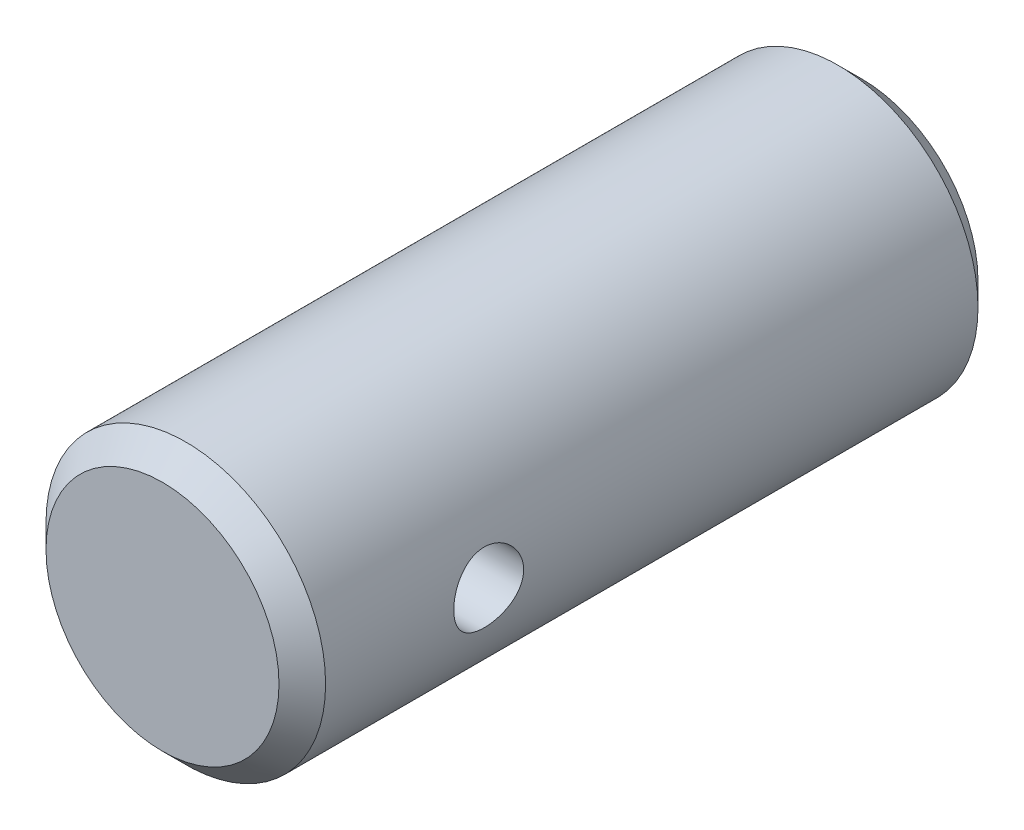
ISO-10303-21;
HEADER;
FILE_DESCRIPTION(('STEP AP214'),'2;1');
FILE_NAME('part.step','',(''),(''),'','','');
FILE_SCHEMA(('AUTOMOTIVE_DESIGN { 1 0 10303 214 1 1 1 1 }'));
ENDSEC;
DATA;
#1=APPLICATION_CONTEXT('core data for automotive mechanical design processes');
#2=APPLICATION_PROTOCOL_DEFINITION('international standard','automotive_design',2000,#1);
#3=PRODUCT_CONTEXT('',#1,'mechanical');
#4=PRODUCT('Part','Part','',(#3));
#5=PRODUCT_RELATED_PRODUCT_CATEGORY('part','',(#4));
#6=PRODUCT_DEFINITION_FORMATION('','',#4);
#7=PRODUCT_DEFINITION_CONTEXT('part definition',#1,'design');
#8=PRODUCT_DEFINITION('design','',#6,#7);
#9=PRODUCT_DEFINITION_SHAPE('','',#8);
#10=(LENGTH_UNIT() NAMED_UNIT(*) SI_UNIT(.MILLI.,.METRE.));
#11=(NAMED_UNIT(*) PLANE_ANGLE_UNIT() SI_UNIT($,.RADIAN.));
#12=(NAMED_UNIT(*) SI_UNIT($,.STERADIAN.) SOLID_ANGLE_UNIT());
#13=UNCERTAINTY_MEASURE_WITH_UNIT(LENGTH_MEASURE(1.E-05),#10,'distance_accuracy_value','');
#14=(GEOMETRIC_REPRESENTATION_CONTEXT(3) GLOBAL_UNCERTAINTY_ASSIGNED_CONTEXT((#13)) GLOBAL_UNIT_ASSIGNED_CONTEXT((#10,
#11,#12)) REPRESENTATION_CONTEXT('',''));
#15=CARTESIAN_POINT('',(0.,0.,0.));
#16=DIRECTION('',(0.,0.,1.));
#17=DIRECTION('',(1.,0.,0.));
#18=AXIS2_PLACEMENT_3D('',#15,#16,#17);
#19=CARTESIAN_POINT('',(-3.33066907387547E-13,0.,30.));
#20=DIRECTION('',(0.,0.,-1.));
#21=DIRECTION('',(-1.,0.,0.));
#22=AXIS2_PLACEMENT_3D('',#19,#20,#21);
#23=CYLINDRICAL_SURFACE('',#22,6.);
#24=CARTESIAN_POINT('',(-6.00000000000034,0.,23.5));
#25=CARTESIAN_POINT('',(-5.99999859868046,-0.0828760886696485,23.4999976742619));
#26=CARTESIAN_POINT('',(-5.99826578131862,-0.165778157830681,23.4931084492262));
#27=CARTESIAN_POINT('',(-5.99152113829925,-0.32920632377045,23.465774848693));
#28=CARTESIAN_POINT('',(-5.98650745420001,-0.409731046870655,23.4453227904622));
#29=CARTESIAN_POINT('',(-5.97375626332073,-0.566020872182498,23.3915607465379));
#30=CARTESIAN_POINT('',(-5.9660220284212,-0.64179156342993,23.3582662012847));
#31=CARTESIAN_POINT('',(-5.94865343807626,-0.78667213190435,23.2798186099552));
#32=CARTESIAN_POINT('',(-5.93901901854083,-0.855781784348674,23.2346651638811));
#33=CARTESIAN_POINT('',(-5.91867413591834,-0.986801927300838,23.1327992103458));
#34=CARTESIAN_POINT('',(-5.90794707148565,-1.048555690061,23.0758884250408));
#35=CARTESIAN_POINT('',(-5.88673620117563,-1.16174892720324,22.9525477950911));
#36=CARTESIAN_POINT('',(-5.87625242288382,-1.21318723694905,22.8861168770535));
#37=CARTESIAN_POINT('',(-5.85654775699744,-1.30502654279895,22.7444047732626));
#38=CARTESIAN_POINT('',(-5.84734794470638,-1.34525221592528,22.6690067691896));
#39=CARTESIAN_POINT('',(-5.83149494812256,-1.41239690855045,22.5122515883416));
#40=CARTESIAN_POINT('',(-5.82484135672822,-1.43931805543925,22.4308953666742));
#41=CARTESIAN_POINT('',(-5.81500476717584,-1.4785548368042,22.2662565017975));
#42=CARTESIAN_POINT('',(-5.81175491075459,-1.49115226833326,22.1830451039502));
#43=CARTESIAN_POINT('',(-5.80889362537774,-1.50226177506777,22.015631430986));
#44=CARTESIAN_POINT('',(-5.80928160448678,-1.5007761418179,21.9314293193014));
#45=CARTESIAN_POINT('',(-5.81359205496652,-1.4839865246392,21.7665841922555));
#46=CARTESIAN_POINT('',(-5.81742863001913,-1.46901834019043,21.6859043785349));
#47=CARTESIAN_POINT('',(-5.82806709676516,-1.42622418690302,21.5282389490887));
#48=CARTESIAN_POINT('',(-5.83486919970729,-1.39839730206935,21.451253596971));
#49=CARTESIAN_POINT('',(-5.85075113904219,-1.33038947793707,21.302261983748));
#50=CARTESIAN_POINT('',(-5.85985327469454,-1.29008666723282,21.2303138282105));
#51=CARTESIAN_POINT('',(-5.87929710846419,-1.1983562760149,21.0940812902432));
#52=CARTESIAN_POINT('',(-5.88963902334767,-1.14692674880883,21.0297982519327));
#53=CARTESIAN_POINT('',(-5.91075880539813,-1.03266342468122,20.9087963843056));
#54=CARTESIAN_POINT('',(-5.92154069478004,-0.969546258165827,20.8523455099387));
#55=CARTESIAN_POINT('',(-5.94205965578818,-0.834611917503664,20.7507787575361));
#56=CARTESIAN_POINT('',(-5.95179669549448,-0.762794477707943,20.7056632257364));
#57=CARTESIAN_POINT('',(-5.96917732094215,-0.612115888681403,20.6279494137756));
#58=CARTESIAN_POINT('',(-5.97681360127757,-0.533231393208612,20.5953946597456));
#59=CARTESIAN_POINT('',(-5.98907916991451,-0.370876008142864,20.5440826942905));
#60=CARTESIAN_POINT('',(-5.99370903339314,-0.287405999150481,20.5253228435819));
#61=CARTESIAN_POINT('',(-5.99935499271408,-0.120539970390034,20.5025424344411));
#62=CARTESIAN_POINT('',(-6.00046053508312,-0.037196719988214,20.4981569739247));
#63=CARTESIAN_POINT('',(-5.99918804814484,0.129032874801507,20.5032490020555));
#64=CARTESIAN_POINT('',(-5.9968103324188,0.211919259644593,20.5127252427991));
#65=CARTESIAN_POINT('',(-5.98889581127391,0.373614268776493,20.5449709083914));
#66=CARTESIAN_POINT('',(-5.98340634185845,0.452465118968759,20.567541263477));
#67=CARTESIAN_POINT('',(-5.96988706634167,0.605257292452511,20.6251070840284));
#68=CARTESIAN_POINT('',(-5.96185700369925,0.679198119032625,20.6601038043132));
#69=CARTESIAN_POINT('',(-5.94393307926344,0.821523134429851,20.7422361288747));
#70=CARTESIAN_POINT('',(-5.93400867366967,0.889785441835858,20.7895761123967));
#71=CARTESIAN_POINT('',(-5.91344509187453,1.01752661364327,20.8947899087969));
#72=CARTESIAN_POINT('',(-5.90280579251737,1.077003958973,20.9526655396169));
#73=CARTESIAN_POINT('',(-5.88168956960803,1.18699056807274,21.0790019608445));
#74=CARTESIAN_POINT('',(-5.87122304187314,1.23724386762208,21.1476877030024));
#75=CARTESIAN_POINT('',(-5.85192878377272,1.32551075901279,21.2927326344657));
#76=CARTESIAN_POINT('',(-5.84310098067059,1.36352489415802,21.3690914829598));
#77=CARTESIAN_POINT('',(-5.82818094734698,1.42595142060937,21.5269057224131));
#78=CARTESIAN_POINT('',(-5.82207255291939,1.45044439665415,21.608327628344));
#79=CARTESIAN_POINT('',(-5.81326744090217,1.48534565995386,21.7743096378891));
#80=CARTESIAN_POINT('',(-5.81056997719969,1.49575702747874,21.8588690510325));
#81=CARTESIAN_POINT('',(-5.80894901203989,1.50203859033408,22.0261210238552));
#82=CARTESIAN_POINT('',(-5.80991932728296,1.4983178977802,22.1087974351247));
#83=CARTESIAN_POINT('',(-5.81527909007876,1.47737727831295,22.272303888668));
#84=CARTESIAN_POINT('',(-5.81966846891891,1.46015762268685,22.3531339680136));
#85=CARTESIAN_POINT('',(-5.83131260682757,1.41293131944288,22.5102084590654));
#86=CARTESIAN_POINT('',(-5.83855015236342,1.38300140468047,22.5864773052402));
#87=CARTESIAN_POINT('',(-5.85507755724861,1.31126491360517,22.7329653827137));
#88=CARTESIAN_POINT('',(-5.86436770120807,1.26945669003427,22.8031837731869));
#89=CARTESIAN_POINT('',(-5.88425634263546,1.17386774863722,22.937554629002));
#90=CARTESIAN_POINT('',(-5.8948826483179,1.11980316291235,23.001501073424));
#91=CARTESIAN_POINT('',(-5.91608027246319,1.00178937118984,23.1195470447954));
#92=CARTESIAN_POINT('',(-5.92665157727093,0.937837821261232,23.173644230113));
#93=CARTESIAN_POINT('',(-5.94677655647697,0.800467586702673,23.2714113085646));
#94=CARTESIAN_POINT('',(-5.95630833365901,0.72689842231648,23.3148746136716));
#95=CARTESIAN_POINT('',(-5.97304924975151,0.573266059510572,23.3887474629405));
#96=CARTESIAN_POINT('',(-5.98026005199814,0.493207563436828,23.4191663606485));
#97=CARTESIAN_POINT('',(-5.99048059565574,0.344410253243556,23.4615718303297));
#98=CARTESIAN_POINT('',(-5.99402585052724,0.276380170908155,23.4759512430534));
#99=CARTESIAN_POINT('',(-5.99878605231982,0.13890607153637,23.495165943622));
#100=CARTESIAN_POINT('',(-6.00000117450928,0.0694621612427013,23.5000019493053));
#101=CARTESIAN_POINT('',(-6.00000000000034,0.,23.5));
#102=B_SPLINE_CURVE_WITH_KNOTS('',3,(#24,#25,#26,#27,#28,#29,#30,#31,#32,#33,#34,#35,#36,#37,
#38,#39,#40,#41,#42,#43,#44,#45,#46,#47,#48,#49,#50,#51,#52,#53,#54,#55,#56,#57,#58,#59,#60,#61,
#62,#63,#64,#65,#66,#67,#68,#69,#70,#71,#72,#73,#74,#75,#76,#77,#78,#79,#80,#81,#82,#83,#84,#85,
#86,#87,#88,#89,#90,#91,#92,#93,#94,#95,#96,#97,#98,#99,#100,#101),.UNSPECIFIED.,.T.,.F.,(4,2,2,
2,2,2,2,2,2,2,2,2,2,2,2,2,2,2,2,2,2,2,2,2,2,2,2,2,2,2,2,2,2,2,2,2,2,2,4),(0.,0.24837371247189,
0.496888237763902,0.745104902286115,0.993329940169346,1.24614435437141,1.49898729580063,
1.75558647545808,2.0121446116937,2.26356295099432,2.51494038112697,2.76022497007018,
3.00552703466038,3.25330527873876,3.50112690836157,3.75601500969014,4.01091089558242,
4.26668229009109,4.52240473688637,4.7715830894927,5.02073901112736,5.26620274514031,
5.51169127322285,5.76153587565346,6.01142363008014,6.26744509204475,6.52345518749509,
6.77792254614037,7.03233423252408,7.27943780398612,7.52653640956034,7.77216400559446,
8.01782568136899,8.26989576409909,8.52202569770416,8.77872185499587,9.03523363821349,
9.24342242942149,9.4515955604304),.UNSPECIFIED.);
#103=CARTESIAN_POINT('',(-6.00000000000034,0.,23.5));
#104=VERTEX_POINT('',#103);
#105=EDGE_CURVE('E28',#104,#104,#102,.T.);
#106=ORIENTED_EDGE('',*,*,#105,.T.);
#107=EDGE_LOOP('',(#106));
#108=FACE_BOUND('',#107,.T.);
#109=CARTESIAN_POINT('',(5.99999999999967,0.,20.5));
#110=CARTESIAN_POINT('',(5.9999985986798,-0.0828760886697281,20.5000023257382));
#111=CARTESIAN_POINT('',(5.99826578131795,-0.165778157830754,20.5068915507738));
#112=CARTESIAN_POINT('',(5.99152113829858,-0.32920632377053,20.534225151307));
#113=CARTESIAN_POINT('',(5.98650745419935,-0.40973104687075,20.5546772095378));
#114=CARTESIAN_POINT('',(5.97375626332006,-0.566020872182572,20.6084392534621));
#115=CARTESIAN_POINT('',(5.96602202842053,-0.641791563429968,20.6417337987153));
#116=CARTESIAN_POINT('',(5.94865343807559,-0.786672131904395,20.7201813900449));
#117=CARTESIAN_POINT('',(5.93901901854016,-0.855781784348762,20.7653348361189));
#118=CARTESIAN_POINT('',(5.91867413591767,-0.986801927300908,20.8672007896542));
#119=CARTESIAN_POINT('',(5.90794707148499,-1.04855569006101,20.9241115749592));
#120=CARTESIAN_POINT('',(5.88673620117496,-1.16174892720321,21.047452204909));
#121=CARTESIAN_POINT('',(5.87625242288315,-1.21318723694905,21.1138831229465));
#122=CARTESIAN_POINT('',(5.85654775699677,-1.30502654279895,21.2555952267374));
#123=CARTESIAN_POINT('',(5.84734794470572,-1.34525221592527,21.3309932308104));
#124=CARTESIAN_POINT('',(5.8314949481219,-1.41239690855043,21.4877484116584));
#125=CARTESIAN_POINT('',(5.82484135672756,-1.43931805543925,21.5691046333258));
#126=CARTESIAN_POINT('',(5.81500476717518,-1.47855483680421,21.7337434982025));
#127=CARTESIAN_POINT('',(5.81175491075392,-1.49115226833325,21.8169548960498));
#128=CARTESIAN_POINT('',(5.80889362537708,-1.50226177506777,21.984368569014));
#129=CARTESIAN_POINT('',(5.80928160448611,-1.50077614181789,22.0685706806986));
#130=CARTESIAN_POINT('',(5.81359205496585,-1.4839865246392,22.2334158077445));
#131=CARTESIAN_POINT('',(5.81742863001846,-1.46901834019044,22.3140956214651));
#132=CARTESIAN_POINT('',(5.82806709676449,-1.42622418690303,22.4717610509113));
#133=CARTESIAN_POINT('',(5.83486919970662,-1.39839730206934,22.548746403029));
#134=CARTESIAN_POINT('',(5.85075113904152,-1.33038947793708,22.6977380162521));
#135=CARTESIAN_POINT('',(5.85985327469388,-1.29008666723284,22.7696861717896));
#136=CARTESIAN_POINT('',(5.87929710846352,-1.19835627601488,22.9059187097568));
#137=CARTESIAN_POINT('',(5.88963902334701,-1.14692674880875,22.9702017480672));
#138=CARTESIAN_POINT('',(5.91075880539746,-1.03266342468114,23.0912036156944));
#139=CARTESIAN_POINT('',(5.92154069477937,-0.969546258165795,23.1476544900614));
#140=CARTESIAN_POINT('',(5.94205965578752,-0.834611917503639,23.2492212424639));
#141=CARTESIAN_POINT('',(5.95179669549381,-0.762794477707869,23.2943367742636));
#142=CARTESIAN_POINT('',(5.96917732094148,-0.612115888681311,23.3720505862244));
#143=CARTESIAN_POINT('',(5.97681360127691,-0.53323139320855,23.4046053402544));
#144=CARTESIAN_POINT('',(5.98907916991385,-0.370876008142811,23.4559173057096));
#145=CARTESIAN_POINT('',(5.99370903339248,-0.287405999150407,23.4746771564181));
#146=CARTESIAN_POINT('',(5.99935499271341,-0.120539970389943,23.4974575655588));
#147=CARTESIAN_POINT('',(6.00046053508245,-0.0371967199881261,23.5018430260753));
#148=CARTESIAN_POINT('',(5.99918804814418,0.129032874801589,23.4967509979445));
#149=CARTESIAN_POINT('',(5.99681033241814,0.211919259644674,23.4872747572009));
#150=CARTESIAN_POINT('',(5.98889581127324,0.373614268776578,23.4550290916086));
#151=CARTESIAN_POINT('',(5.98340634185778,0.452465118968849,23.432458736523));
#152=CARTESIAN_POINT('',(5.969887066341,0.605257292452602,23.3748929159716));
#153=CARTESIAN_POINT('',(5.96185700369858,0.679198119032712,23.3398961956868));
#154=CARTESIAN_POINT('',(5.94393307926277,0.821523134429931,23.2577638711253));
#155=CARTESIAN_POINT('',(5.93400867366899,0.889785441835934,23.2104238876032));
#156=CARTESIAN_POINT('',(5.91344509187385,1.01752661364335,23.105210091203));
#157=CARTESIAN_POINT('',(5.9028057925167,1.07700395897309,23.0473344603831));
#158=CARTESIAN_POINT('',(5.88168956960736,1.18699056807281,22.9209980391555));
#159=CARTESIAN_POINT('',(5.87122304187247,1.23724386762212,22.8523122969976));
#160=CARTESIAN_POINT('',(5.85192878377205,1.32551075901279,22.7072673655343));
#161=CARTESIAN_POINT('',(5.84310098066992,1.36352489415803,22.6309085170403));
#162=CARTESIAN_POINT('',(5.82818094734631,1.42595142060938,22.4730942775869));
#163=CARTESIAN_POINT('',(5.82207255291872,1.45044439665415,22.391672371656));
#164=CARTESIAN_POINT('',(5.8132674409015,1.48534565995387,22.2256903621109));
#165=CARTESIAN_POINT('',(5.81056997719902,1.49575702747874,22.1411309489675));
#166=CARTESIAN_POINT('',(5.80894901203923,1.50203859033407,21.9738789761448));
#167=CARTESIAN_POINT('',(5.8099193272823,1.4983178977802,21.8912025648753));
#168=CARTESIAN_POINT('',(5.8152790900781,1.47737727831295,21.727696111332));
#169=CARTESIAN_POINT('',(5.81966846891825,1.46015762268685,21.6468660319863));
#170=CARTESIAN_POINT('',(5.8313126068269,1.41293131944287,21.4897915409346));
#171=CARTESIAN_POINT('',(5.83855015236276,1.38300140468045,21.4135226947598));
#172=CARTESIAN_POINT('',(5.85507755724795,1.31126491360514,21.2670346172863));
#173=CARTESIAN_POINT('',(5.8643677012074,1.26945669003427,21.1968162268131));
#174=CARTESIAN_POINT('',(5.88425634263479,1.17386774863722,21.062445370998));
#175=CARTESIAN_POINT('',(5.89488264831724,1.11980316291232,20.998498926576));
#176=CARTESIAN_POINT('',(5.91608027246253,1.00178937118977,20.8804529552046));
#177=CARTESIAN_POINT('',(5.92665157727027,0.93783782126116,20.826355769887));
#178=CARTESIAN_POINT('',(5.9467765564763,0.800467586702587,20.7285886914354));
#179=CARTESIAN_POINT('',(5.95630833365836,0.726898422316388,20.6851253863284));
#180=CARTESIAN_POINT('',(5.97304924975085,0.573266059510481,20.6112525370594));
#181=CARTESIAN_POINT('',(5.98026005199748,0.493207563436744,20.5808336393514));
#182=CARTESIAN_POINT('',(5.99048059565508,0.344410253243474,20.5384281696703));
#183=CARTESIAN_POINT('',(5.99402585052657,0.27638017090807,20.5240487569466));
#184=CARTESIAN_POINT('',(5.99878605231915,0.138906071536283,20.5048340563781));
#185=CARTESIAN_POINT('',(6.00000117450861,0.0694621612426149,20.4999980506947));
#186=CARTESIAN_POINT('',(5.99999999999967,0.,20.5));
#187=B_SPLINE_CURVE_WITH_KNOTS('',3,(#109,#110,#111,#112,#113,#114,#115,#116,#117,#118,#119,
#120,#121,#122,#123,#124,#125,#126,#127,#128,#129,#130,#131,#132,#133,#134,#135,#136,#137,#138,
#139,#140,#141,#142,#143,#144,#145,#146,#147,#148,#149,#150,#151,#152,#153,#154,#155,#156,#157,
#158,#159,#160,#161,#162,#163,#164,#165,#166,#167,#168,#169,#170,#171,#172,#173,#174,#175,#176,
#177,#178,#179,#180,#181,#182,#183,#184,#185,#186),.UNSPECIFIED.,.T.,.F.,(4,2,2,2,2,2,2,2,2,2,2,
2,2,2,2,2,2,2,2,2,2,2,2,2,2,2,2,2,2,2,2,2,2,2,2,2,2,2,4),(0.,0.248373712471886,
0.496888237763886,0.745104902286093,0.993329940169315,1.24614435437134,1.49898729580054,
1.75558647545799,2.0121446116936,2.26356295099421,2.51494038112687,2.76022497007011,
3.00552703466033,3.25330527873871,3.50112690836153,3.75601500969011,4.01091089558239,
4.26668229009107,4.52240473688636,4.77158308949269,5.02073901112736,5.26620274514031,
5.51169127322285,5.76153587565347,6.01142363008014,6.2674450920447,6.523455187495,
6.7779225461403,7.03233423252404,7.27943780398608,7.5265364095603,7.77216400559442,
8.01782568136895,8.26989576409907,8.52202569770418,8.77872185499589,9.03523363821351,
9.24342242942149,9.4515955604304),.UNSPECIFIED.);
#188=CARTESIAN_POINT('',(5.99999999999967,0.,20.5));
#189=VERTEX_POINT('',#188);
#190=EDGE_CURVE('E43',#189,#189,#187,.T.);
#191=ORIENTED_EDGE('',*,*,#190,.T.);
#192=EDGE_LOOP('',(#191));
#193=FACE_BOUND('',#192,.T.);
#194=CARTESIAN_POINT('',(-3.33066907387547E-13,0.,29.));
#195=DIRECTION('',(0.,0.,1.));
#196=DIRECTION('',(1.,0.,0.));
#197=AXIS2_PLACEMENT_3D('',#194,#195,#196);
#198=CIRCLE('',#197,6.);
#199=CARTESIAN_POINT('',(5.99999999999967,0.,29.));
#200=VERTEX_POINT('',#199);
#201=EDGE_CURVE('E35',#200,#200,#198,.F.);
#202=ORIENTED_EDGE('',*,*,#201,.T.);
#203=EDGE_LOOP('',(#202));
#204=FACE_BOUND('',#203,.T.);
#205=CARTESIAN_POINT('',(0.,0.,1.));
#206=DIRECTION('',(0.,0.,1.));
#207=DIRECTION('',(1.,0.,0.));
#208=AXIS2_PLACEMENT_3D('',#205,#206,#207);
#209=CIRCLE('',#208,6.);
#210=CARTESIAN_POINT('',(6.,0.,1.));
#211=VERTEX_POINT('',#210);
#212=EDGE_CURVE('E40',#211,#211,#209,.T.);
#213=ORIENTED_EDGE('',*,*,#212,.T.);
#214=EDGE_LOOP('',(#213));
#215=FACE_BOUND('',#214,.T.);
#216=ADVANCED_FACE('F24',(#108,#193,#204,#215),#23,.T.);
#217=CARTESIAN_POINT('',(-3.33066907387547E-13,0.,30.));
#218=DIRECTION('',(0.,0.,1.));
#219=DIRECTION('',(1.,0.,0.));
#220=AXIS2_PLACEMENT_3D('',#217,#218,#219);
#221=PLANE('',#220);
#222=CARTESIAN_POINT('',(-3.33066907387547E-13,0.,30.));
#223=DIRECTION('',(0.,0.,1.));
#224=DIRECTION('',(1.,0.,0.));
#225=AXIS2_PLACEMENT_3D('',#222,#223,#224);
#226=CIRCLE('',#225,5.);
#227=CARTESIAN_POINT('',(4.99999999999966,0.,30.));
#228=VERTEX_POINT('',#227);
#229=EDGE_CURVE('E72',#228,#228,#226,.T.);
#230=ORIENTED_EDGE('',*,*,#229,.T.);
#231=EDGE_LOOP('',(#230));
#232=FACE_BOUND('',#231,.T.);
#233=ADVANCED_FACE('F63',(#232),#221,.T.);
#234=CARTESIAN_POINT('',(0.,0.,0.));
#235=DIRECTION('',(0.,0.,1.));
#236=DIRECTION('',(1.,0.,0.));
#237=AXIS2_PLACEMENT_3D('',#234,#235,#236);
#238=PLANE('',#237);
#239=CARTESIAN_POINT('',(0.,0.,0.));
#240=DIRECTION('',(0.,0.,1.));
#241=DIRECTION('',(1.,0.,0.));
#242=AXIS2_PLACEMENT_3D('',#239,#240,#241);
#243=CIRCLE('',#242,4.99999999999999);
#244=CARTESIAN_POINT('',(4.99999999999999,0.,0.));
#245=VERTEX_POINT('',#244);
#246=EDGE_CURVE('E10',#245,#245,#243,.F.);
#247=ORIENTED_EDGE('',*,*,#246,.T.);
#248=EDGE_LOOP('',(#247));
#249=FACE_BOUND('',#248,.T.);
#250=ADVANCED_FACE('F60',(#249),#238,.F.);
#251=CARTESIAN_POINT('',(-3.33066907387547E-13,0.,30.));
#252=DIRECTION('',(0.,0.,-1.));
#253=DIRECTION('',(-1.,0.,0.));
#254=AXIS2_PLACEMENT_3D('',#251,#252,#253);
#255=CONICAL_SURFACE('',#254,5.,0.785398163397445);
#256=ORIENTED_EDGE('',*,*,#201,.F.);
#257=EDGE_LOOP('',(#256));
#258=FACE_BOUND('',#257,.T.);
#259=ORIENTED_EDGE('',*,*,#229,.F.);
#260=EDGE_LOOP('',(#259));
#261=FACE_BOUND('',#260,.T.);
#262=ADVANCED_FACE('F56',(#258,#261),#255,.T.);
#263=CARTESIAN_POINT('',(0.,0.,1.));
#264=DIRECTION('',(0.,0.,1.));
#265=DIRECTION('',(1.,0.,0.));
#266=AXIS2_PLACEMENT_3D('',#263,#264,#265);
#267=CONICAL_SURFACE('',#266,6.,0.78539816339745);
#268=ORIENTED_EDGE('',*,*,#246,.F.);
#269=EDGE_LOOP('',(#268));
#270=FACE_BOUND('',#269,.T.);
#271=ORIENTED_EDGE('',*,*,#212,.F.);
#272=EDGE_LOOP('',(#271));
#273=FACE_BOUND('',#272,.T.);
#274=ADVANCED_FACE('F51',(#270,#273),#267,.T.);
#275=CARTESIAN_POINT('',(-30.0000000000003,0.,22.));
#276=DIRECTION('',(1.,0.,0.));
#277=DIRECTION('',(0.,0.,-1.));
#278=AXIS2_PLACEMENT_3D('',#275,#276,#277);
#279=CYLINDRICAL_SURFACE('',#278,1.5);
#280=ORIENTED_EDGE('',*,*,#190,.F.);
#281=EDGE_LOOP('',(#280));
#282=FACE_BOUND('',#281,.T.);
#283=ORIENTED_EDGE('',*,*,#105,.F.);
#284=EDGE_LOOP('',(#283));
#285=FACE_BOUND('',#284,.T.);
#286=ADVANCED_FACE('F47',(#282,#285),#279,.F.);
#287=CLOSED_SHELL('',(#216,#233,#250,#262,#274,#286));
#288=MANIFOLD_SOLID_BREP('B2',#287);
#289=ADVANCED_BREP_SHAPE_REPRESENTATION('',(#18,#288),#14);
#290=SHAPE_DEFINITION_REPRESENTATION(#9,#289);
ENDSEC;
END-ISO-10303-21;
